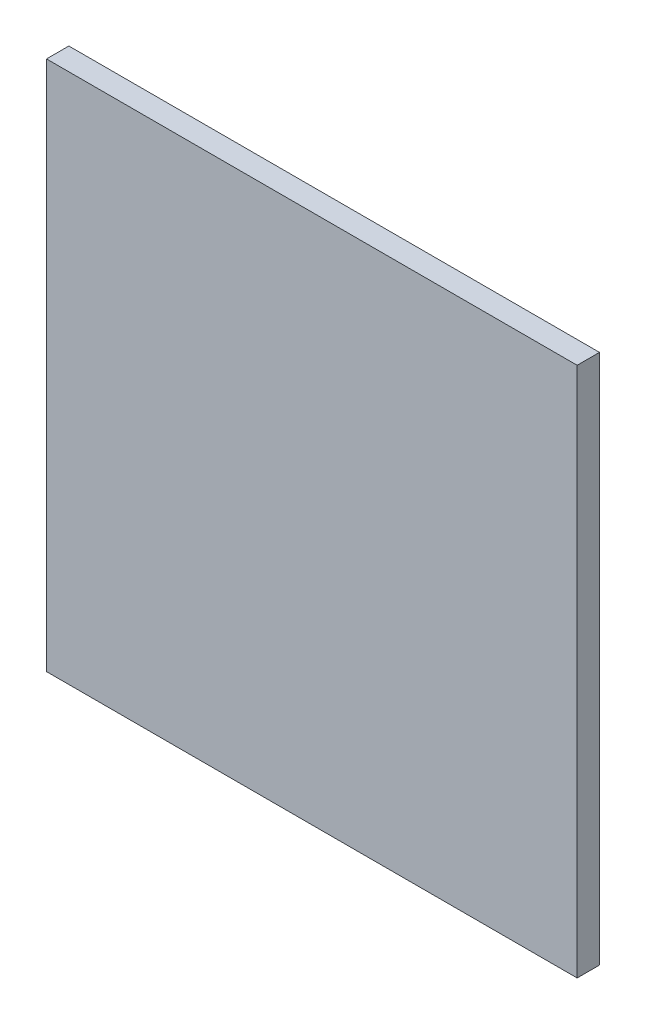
ISO-10303-21;
HEADER;
FILE_DESCRIPTION(('STEP AP214'),'2;1');
FILE_NAME('part.step','',(''),(''),'','','');
FILE_SCHEMA(('AUTOMOTIVE_DESIGN { 1 0 10303 214 1 1 1 1 }'));
ENDSEC;
DATA;
#1=APPLICATION_CONTEXT('core data for automotive mechanical design processes');
#2=APPLICATION_PROTOCOL_DEFINITION('international standard','automotive_design',2000,#1);
#3=PRODUCT_CONTEXT('',#1,'mechanical');
#4=PRODUCT('Part','Part','',(#3));
#5=PRODUCT_RELATED_PRODUCT_CATEGORY('part','',(#4));
#6=PRODUCT_DEFINITION_FORMATION('','',#4);
#7=PRODUCT_DEFINITION_CONTEXT('part definition',#1,'design');
#8=PRODUCT_DEFINITION('design','',#6,#7);
#9=PRODUCT_DEFINITION_SHAPE('','',#8);
#10=(LENGTH_UNIT() NAMED_UNIT(*) SI_UNIT(.MILLI.,.METRE.));
#11=(NAMED_UNIT(*) PLANE_ANGLE_UNIT() SI_UNIT($,.RADIAN.));
#12=(NAMED_UNIT(*) SI_UNIT($,.STERADIAN.) SOLID_ANGLE_UNIT());
#13=UNCERTAINTY_MEASURE_WITH_UNIT(LENGTH_MEASURE(1.E-05),#10,'distance_accuracy_value','');
#14=(GEOMETRIC_REPRESENTATION_CONTEXT(3) GLOBAL_UNCERTAINTY_ASSIGNED_CONTEXT((#13)) GLOBAL_UNIT_ASSIGNED_CONTEXT((#10,
#11,#12)) REPRESENTATION_CONTEXT('',''));
#15=CARTESIAN_POINT('',(0.,0.,0.));
#16=DIRECTION('',(0.,0.,1.));
#17=DIRECTION('',(1.,0.,0.));
#18=AXIS2_PLACEMENT_3D('',#15,#16,#17);
#19=CARTESIAN_POINT('',(0.,0.,0.8));
#20=DIRECTION('',(1.,0.,0.));
#21=DIRECTION('',(0.,0.,-1.));
#22=AXIS2_PLACEMENT_3D('',#19,#20,#21);
#23=PLANE('',#22);
#24=DIRECTION('',(0.,-1.,0.));
#25=VECTOR('',#24,1.);
#26=CARTESIAN_POINT('',(0.,0.,0.));
#27=LINE('',#26,#25);
#28=CARTESIAN_POINT('',(0.,19.,0.));
#29=VERTEX_POINT('',#28);
#30=CARTESIAN_POINT('',(0.,0.,0.));
#31=VERTEX_POINT('',#30);
#32=EDGE_CURVE('E93',#29,#31,#27,.T.);
#33=ORIENTED_EDGE('',*,*,#32,.T.);
#34=DIRECTION('',(0.,0.,-1.));
#35=VECTOR('',#34,1.);
#36=CARTESIAN_POINT('',(0.,0.,0.8));
#37=LINE('',#36,#35);
#38=CARTESIAN_POINT('',(0.,0.,0.8));
#39=VERTEX_POINT('',#38);
#40=EDGE_CURVE('E11',#39,#31,#37,.T.);
#41=ORIENTED_EDGE('',*,*,#40,.F.);
#42=DIRECTION('',(0.,-1.,0.));
#43=VECTOR('',#42,1.);
#44=CARTESIAN_POINT('',(0.,0.,0.8));
#45=LINE('',#44,#43);
#46=CARTESIAN_POINT('',(0.,19.,0.8));
#47=VERTEX_POINT('',#46);
#48=EDGE_CURVE('E81',#47,#39,#45,.T.);
#49=ORIENTED_EDGE('',*,*,#48,.F.);
#50=DIRECTION('',(0.,0.,-1.));
#51=VECTOR('',#50,1.);
#52=CARTESIAN_POINT('',(0.,19.,0.8));
#53=LINE('',#52,#51);
#54=EDGE_CURVE('E89',#47,#29,#53,.T.);
#55=ORIENTED_EDGE('',*,*,#54,.T.);
#56=EDGE_LOOP('',(#33,#41,#49,#55));
#57=FACE_BOUND('',#56,.T.);
#58=ADVANCED_FACE('F30',(#57),#23,.F.);
#59=CARTESIAN_POINT('',(0.,0.,0.8));
#60=DIRECTION('',(0.,1.,0.));
#61=DIRECTION('',(0.,0.,1.));
#62=AXIS2_PLACEMENT_3D('',#59,#60,#61);
#63=PLANE('',#62);
#64=DIRECTION('',(1.,0.,0.));
#65=VECTOR('',#64,1.);
#66=CARTESIAN_POINT('',(0.,0.,0.));
#67=LINE('',#66,#65);
#68=CARTESIAN_POINT('',(19.,0.,0.));
#69=VERTEX_POINT('',#68);
#70=EDGE_CURVE('E85',#31,#69,#67,.T.);
#71=ORIENTED_EDGE('',*,*,#70,.T.);
#72=DIRECTION('',(0.,0.,-1.));
#73=VECTOR('',#72,1.);
#74=CARTESIAN_POINT('',(19.,0.,0.8));
#75=LINE('',#74,#73);
#76=CARTESIAN_POINT('',(19.,0.,0.8));
#77=VERTEX_POINT('',#76);
#78=EDGE_CURVE('E38',#77,#69,#75,.T.);
#79=ORIENTED_EDGE('',*,*,#78,.F.);
#80=DIRECTION('',(1.,0.,0.));
#81=VECTOR('',#80,1.);
#82=CARTESIAN_POINT('',(0.,0.,0.8));
#83=LINE('',#82,#81);
#84=EDGE_CURVE('E76',#39,#77,#83,.T.);
#85=ORIENTED_EDGE('',*,*,#84,.F.);
#86=ORIENTED_EDGE('',*,*,#40,.T.);
#87=EDGE_LOOP('',(#71,#79,#85,#86));
#88=FACE_BOUND('',#87,.T.);
#89=ADVANCED_FACE('F84',(#88),#63,.F.);
#90=CARTESIAN_POINT('',(19.,0.,0.8));
#91=DIRECTION('',(-1.,0.,0.));
#92=DIRECTION('',(0.,0.,1.));
#93=AXIS2_PLACEMENT_3D('',#90,#91,#92);
#94=PLANE('',#93);
#95=DIRECTION('',(0.,1.,0.));
#96=VECTOR('',#95,1.);
#97=CARTESIAN_POINT('',(19.,0.,0.));
#98=LINE('',#97,#96);
#99=CARTESIAN_POINT('',(19.,19.,0.));
#100=VERTEX_POINT('',#99);
#101=EDGE_CURVE('E63',#69,#100,#98,.T.);
#102=ORIENTED_EDGE('',*,*,#101,.T.);
#103=DIRECTION('',(0.,0.,-1.));
#104=VECTOR('',#103,1.);
#105=CARTESIAN_POINT('',(19.,19.,0.8));
#106=LINE('',#105,#104);
#107=CARTESIAN_POINT('',(19.,19.,0.8));
#108=VERTEX_POINT('',#107);
#109=EDGE_CURVE('E86',#108,#100,#106,.T.);
#110=ORIENTED_EDGE('',*,*,#109,.F.);
#111=DIRECTION('',(0.,1.,0.));
#112=VECTOR('',#111,1.);
#113=CARTESIAN_POINT('',(19.,0.,0.8));
#114=LINE('',#113,#112);
#115=EDGE_CURVE('E79',#77,#108,#114,.T.);
#116=ORIENTED_EDGE('',*,*,#115,.F.);
#117=ORIENTED_EDGE('',*,*,#78,.T.);
#118=EDGE_LOOP('',(#102,#110,#116,#117));
#119=FACE_BOUND('',#118,.T.);
#120=ADVANCED_FACE('F87',(#119),#94,.F.);
#121=CARTESIAN_POINT('',(0.,19.,0.8));
#122=DIRECTION('',(0.,-1.,0.));
#123=DIRECTION('',(0.,0.,-1.));
#124=AXIS2_PLACEMENT_3D('',#121,#122,#123);
#125=PLANE('',#124);
#126=DIRECTION('',(-1.,0.,0.));
#127=VECTOR('',#126,1.);
#128=CARTESIAN_POINT('',(0.,19.,0.));
#129=LINE('',#128,#127);
#130=EDGE_CURVE('E69',#100,#29,#129,.T.);
#131=ORIENTED_EDGE('',*,*,#130,.T.);
#132=ORIENTED_EDGE('',*,*,#54,.F.);
#133=DIRECTION('',(-1.,0.,0.));
#134=VECTOR('',#133,1.);
#135=CARTESIAN_POINT('',(0.,19.,0.8));
#136=LINE('',#135,#134);
#137=EDGE_CURVE('E46',#108,#47,#136,.T.);
#138=ORIENTED_EDGE('',*,*,#137,.F.);
#139=ORIENTED_EDGE('',*,*,#109,.T.);
#140=EDGE_LOOP('',(#131,#132,#138,#139));
#141=FACE_BOUND('',#140,.T.);
#142=ADVANCED_FACE('F100',(#141),#125,.F.);
#143=CARTESIAN_POINT('',(0.,19.,0.8));
#144=DIRECTION('',(0.,0.,-1.));
#145=DIRECTION('',(-1.,0.,0.));
#146=AXIS2_PLACEMENT_3D('',#143,#144,#145);
#147=PLANE('',#146);
#148=ORIENTED_EDGE('',*,*,#48,.T.);
#149=ORIENTED_EDGE('',*,*,#84,.T.);
#150=ORIENTED_EDGE('',*,*,#115,.T.);
#151=ORIENTED_EDGE('',*,*,#137,.T.);
#152=EDGE_LOOP('',(#148,#149,#150,#151));
#153=FACE_BOUND('',#152,.T.);
#154=ADVANCED_FACE('F77',(#153),#147,.F.);
#155=CARTESIAN_POINT('',(0.,19.,0.));
#156=DIRECTION('',(0.,0.,-1.));
#157=DIRECTION('',(-1.,0.,0.));
#158=AXIS2_PLACEMENT_3D('',#155,#156,#157);
#159=PLANE('',#158);
#160=ORIENTED_EDGE('',*,*,#32,.F.);
#161=ORIENTED_EDGE('',*,*,#130,.F.);
#162=ORIENTED_EDGE('',*,*,#101,.F.);
#163=ORIENTED_EDGE('',*,*,#70,.F.);
#164=EDGE_LOOP('',(#160,#161,#162,#163));
#165=FACE_BOUND('',#164,.T.);
#166=ADVANCED_FACE('F103',(#165),#159,.T.);
#167=CLOSED_SHELL('',(#58,#89,#120,#142,#154,#166));
#168=MANIFOLD_SOLID_BREP('B2',#167);
#169=ADVANCED_BREP_SHAPE_REPRESENTATION('',(#18,#168),#14);
#170=SHAPE_DEFINITION_REPRESENTATION(#9,#169);
ENDSEC;
END-ISO-10303-21;
